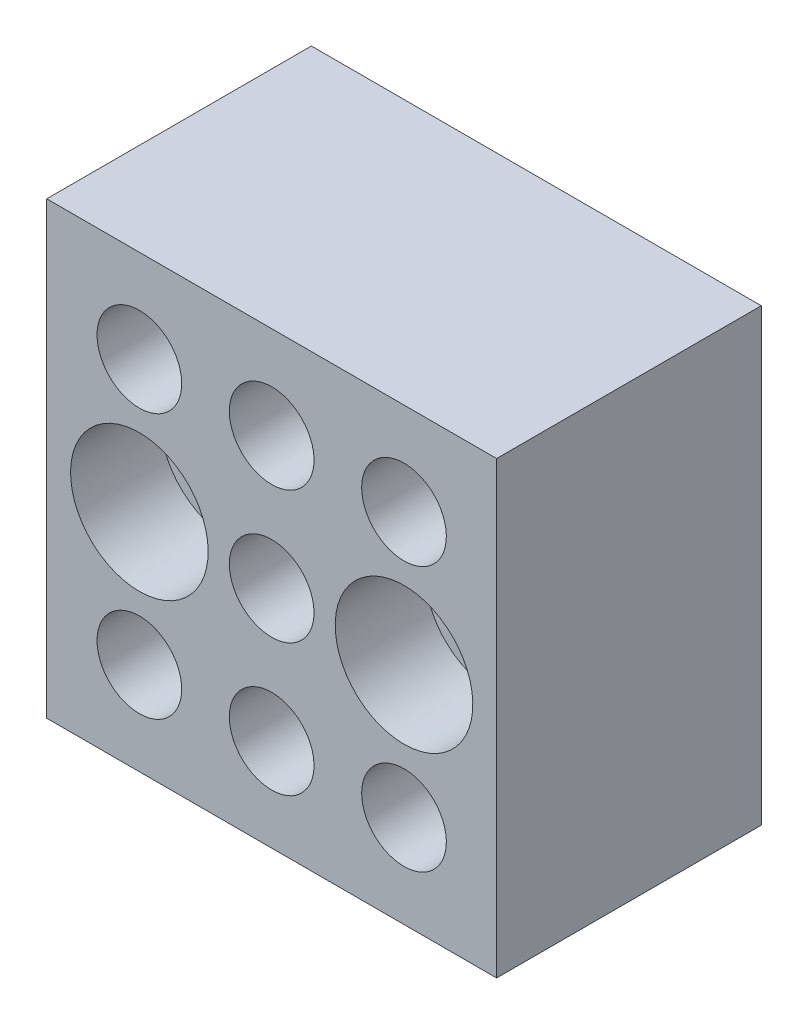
ISO-10303-21;
HEADER;
FILE_DESCRIPTION(('STEP AP214'),'2;1');
FILE_NAME('part.step','',(''),(''),'','','');
FILE_SCHEMA(('AUTOMOTIVE_DESIGN { 1 0 10303 214 1 1 1 1 }'));
ENDSEC;
DATA;
#1=APPLICATION_CONTEXT('core data for automotive mechanical design processes');
#2=APPLICATION_PROTOCOL_DEFINITION('international standard','automotive_design',2000,#1);
#3=PRODUCT_CONTEXT('',#1,'mechanical');
#4=PRODUCT('Part','Part','',(#3));
#5=PRODUCT_RELATED_PRODUCT_CATEGORY('part','',(#4));
#6=PRODUCT_DEFINITION_FORMATION('','',#4);
#7=PRODUCT_DEFINITION_CONTEXT('part definition',#1,'design');
#8=PRODUCT_DEFINITION('design','',#6,#7);
#9=PRODUCT_DEFINITION_SHAPE('','',#8);
#10=(LENGTH_UNIT() NAMED_UNIT(*) SI_UNIT(.MILLI.,.METRE.));
#11=(NAMED_UNIT(*) PLANE_ANGLE_UNIT() SI_UNIT($,.RADIAN.));
#12=(NAMED_UNIT(*) SI_UNIT($,.STERADIAN.) SOLID_ANGLE_UNIT());
#13=UNCERTAINTY_MEASURE_WITH_UNIT(LENGTH_MEASURE(1.E-05),#10,'distance_accuracy_value','');
#14=(GEOMETRIC_REPRESENTATION_CONTEXT(3) GLOBAL_UNCERTAINTY_ASSIGNED_CONTEXT((#13)) GLOBAL_UNIT_ASSIGNED_CONTEXT((#10,
#11,#12)) REPRESENTATION_CONTEXT('',''));
#15=CARTESIAN_POINT('',(0.,0.,0.));
#16=DIRECTION('',(0.,0.,1.));
#17=DIRECTION('',(1.,0.,0.));
#18=AXIS2_PLACEMENT_3D('',#15,#16,#17);
#19=CARTESIAN_POINT('',(50.,25.,50.));
#20=DIRECTION('',(0.,0.,-1.));
#21=DIRECTION('',(0.,1.,0.));
#22=AXIS2_PLACEMENT_3D('',#19,#20,#21);
#23=CYLINDRICAL_SURFACE('',#22,8.);
#24=CARTESIAN_POINT('',(50.,25.,50.));
#25=DIRECTION('',(0.,0.,1.));
#26=DIRECTION('',(0.,-1.,0.));
#27=AXIS2_PLACEMENT_3D('',#24,#25,#26);
#28=CIRCLE('',#27,8.);
#29=CARTESIAN_POINT('',(50.,17.,50.));
#30=VERTEX_POINT('',#29);
#31=EDGE_CURVE('E105',#30,#30,#28,.T.);
#32=ORIENTED_EDGE('',*,*,#31,.T.);
#33=EDGE_LOOP('',(#32));
#34=FACE_BOUND('',#33,.T.);
#35=CARTESIAN_POINT('',(50.,25.,15.));
#36=DIRECTION('',(0.,0.,-1.));
#37=DIRECTION('',(-1.,0.,0.));
#38=AXIS2_PLACEMENT_3D('',#35,#36,#37);
#39=CIRCLE('',#38,8.);
#40=CARTESIAN_POINT('',(42.,25.,15.));
#41=VERTEX_POINT('',#40);
#42=EDGE_CURVE('E187',#41,#41,#39,.T.);
#43=ORIENTED_EDGE('',*,*,#42,.T.);
#44=EDGE_LOOP('',(#43));
#45=FACE_BOUND('',#44,.T.);
#46=ADVANCED_FACE('F14',(#34,#45),#23,.F.);
#47=CARTESIAN_POINT('',(25.,25.,50.));
#48=DIRECTION('',(0.,0.,-1.));
#49=DIRECTION('',(0.,1.,0.));
#50=AXIS2_PLACEMENT_3D('',#47,#48,#49);
#51=CYLINDRICAL_SURFACE('',#50,8.);
#52=CARTESIAN_POINT('',(25.,25.,50.));
#53=DIRECTION('',(0.,0.,1.));
#54=DIRECTION('',(0.,-1.,0.));
#55=AXIS2_PLACEMENT_3D('',#52,#53,#54);
#56=CIRCLE('',#55,8.);
#57=CARTESIAN_POINT('',(25.,17.,50.));
#58=VERTEX_POINT('',#57);
#59=EDGE_CURVE('E99',#58,#58,#56,.T.);
#60=ORIENTED_EDGE('',*,*,#59,.T.);
#61=EDGE_LOOP('',(#60));
#62=FACE_BOUND('',#61,.T.);
#63=CARTESIAN_POINT('',(25.,25.,15.));
#64=DIRECTION('',(0.,0.,-1.));
#65=DIRECTION('',(-1.,0.,0.));
#66=AXIS2_PLACEMENT_3D('',#63,#64,#65);
#67=CIRCLE('',#66,8.);
#68=CARTESIAN_POINT('',(17.,25.,15.));
#69=VERTEX_POINT('',#68);
#70=EDGE_CURVE('E178',#69,#69,#67,.T.);
#71=ORIENTED_EDGE('',*,*,#70,.T.);
#72=EDGE_LOOP('',(#71));
#73=FACE_BOUND('',#72,.T.);
#74=ADVANCED_FACE('F223',(#62,#73),#51,.F.);
#75=CARTESIAN_POINT('',(0.,25.,50.));
#76=DIRECTION('',(0.,0.,-1.));
#77=DIRECTION('',(0.,1.,0.));
#78=AXIS2_PLACEMENT_3D('',#75,#76,#77);
#79=CYLINDRICAL_SURFACE('',#78,8.);
#80=CARTESIAN_POINT('',(0.,25.,50.));
#81=DIRECTION('',(0.,0.,1.));
#82=DIRECTION('',(0.,-1.,0.));
#83=AXIS2_PLACEMENT_3D('',#80,#81,#82);
#84=CIRCLE('',#83,8.);
#85=CARTESIAN_POINT('',(0.,17.,50.));
#86=VERTEX_POINT('',#85);
#87=EDGE_CURVE('E96',#86,#86,#84,.T.);
#88=ORIENTED_EDGE('',*,*,#87,.T.);
#89=EDGE_LOOP('',(#88));
#90=FACE_BOUND('',#89,.T.);
#91=CARTESIAN_POINT('',(0.,25.,15.));
#92=DIRECTION('',(0.,0.,-1.));
#93=DIRECTION('',(-1.,0.,0.));
#94=AXIS2_PLACEMENT_3D('',#91,#92,#93);
#95=CIRCLE('',#94,8.);
#96=CARTESIAN_POINT('',(-8.,25.,15.));
#97=VERTEX_POINT('',#96);
#98=EDGE_CURVE('E169',#97,#97,#95,.T.);
#99=ORIENTED_EDGE('',*,*,#98,.T.);
#100=EDGE_LOOP('',(#99));
#101=FACE_BOUND('',#100,.T.);
#102=ADVANCED_FACE('F229',(#90,#101),#79,.F.);
#103=CARTESIAN_POINT('',(25.,0.,50.));
#104=DIRECTION('',(0.,0.,-1.));
#105=DIRECTION('',(0.,1.,0.));
#106=AXIS2_PLACEMENT_3D('',#103,#104,#105);
#107=CYLINDRICAL_SURFACE('',#106,8.);
#108=CARTESIAN_POINT('',(25.,0.,50.));
#109=DIRECTION('',(0.,0.,1.));
#110=DIRECTION('',(0.,-1.,0.));
#111=AXIS2_PLACEMENT_3D('',#108,#109,#110);
#112=CIRCLE('',#111,8.);
#113=CARTESIAN_POINT('',(25.,-8.,50.));
#114=VERTEX_POINT('',#113);
#115=EDGE_CURVE('E102',#114,#114,#112,.T.);
#116=ORIENTED_EDGE('',*,*,#115,.T.);
#117=EDGE_LOOP('',(#116));
#118=FACE_BOUND('',#117,.T.);
#119=CARTESIAN_POINT('',(25.,0.,15.));
#120=DIRECTION('',(0.,0.,-1.));
#121=DIRECTION('',(-1.,0.,0.));
#122=AXIS2_PLACEMENT_3D('',#119,#120,#121);
#123=CIRCLE('',#122,8.);
#124=CARTESIAN_POINT('',(17.,0.,15.));
#125=VERTEX_POINT('',#124);
#126=EDGE_CURVE('E160',#125,#125,#123,.T.);
#127=ORIENTED_EDGE('',*,*,#126,.T.);
#128=EDGE_LOOP('',(#127));
#129=FACE_BOUND('',#128,.T.);
#130=ADVANCED_FACE('F236',(#118,#129),#107,.F.);
#131=CARTESIAN_POINT('',(0.,-25.,50.));
#132=DIRECTION('',(0.,0.,-1.));
#133=DIRECTION('',(0.,1.,0.));
#134=AXIS2_PLACEMENT_3D('',#131,#132,#133);
#135=CYLINDRICAL_SURFACE('',#134,8.);
#136=CARTESIAN_POINT('',(0.,-25.,50.));
#137=DIRECTION('',(0.,0.,1.));
#138=DIRECTION('',(0.,-1.,0.));
#139=AXIS2_PLACEMENT_3D('',#136,#137,#138);
#140=CIRCLE('',#139,8.);
#141=CARTESIAN_POINT('',(0.,-33.,50.));
#142=VERTEX_POINT('',#141);
#143=EDGE_CURVE('E93',#142,#142,#140,.T.);
#144=ORIENTED_EDGE('',*,*,#143,.T.);
#145=EDGE_LOOP('',(#144));
#146=FACE_BOUND('',#145,.T.);
#147=CARTESIAN_POINT('',(0.,-25.,15.));
#148=DIRECTION('',(0.,0.,-1.));
#149=DIRECTION('',(-1.,0.,0.));
#150=AXIS2_PLACEMENT_3D('',#147,#148,#149);
#151=CIRCLE('',#150,8.);
#152=CARTESIAN_POINT('',(-8.,-25.,15.));
#153=VERTEX_POINT('',#152);
#154=EDGE_CURVE('E151',#153,#153,#151,.T.);
#155=ORIENTED_EDGE('',*,*,#154,.T.);
#156=EDGE_LOOP('',(#155));
#157=FACE_BOUND('',#156,.T.);
#158=ADVANCED_FACE('F238',(#146,#157),#135,.F.);
#159=CARTESIAN_POINT('',(25.,-25.,50.));
#160=DIRECTION('',(0.,0.,-1.));
#161=DIRECTION('',(0.,1.,0.));
#162=AXIS2_PLACEMENT_3D('',#159,#160,#161);
#163=CYLINDRICAL_SURFACE('',#162,8.);
#164=CARTESIAN_POINT('',(25.,-25.,50.));
#165=DIRECTION('',(0.,0.,1.));
#166=DIRECTION('',(0.,-1.,0.));
#167=AXIS2_PLACEMENT_3D('',#164,#165,#166);
#168=CIRCLE('',#167,8.);
#169=CARTESIAN_POINT('',(25.,-33.,50.));
#170=VERTEX_POINT('',#169);
#171=EDGE_CURVE('E72',#170,#170,#168,.T.);
#172=ORIENTED_EDGE('',*,*,#171,.T.);
#173=EDGE_LOOP('',(#172));
#174=FACE_BOUND('',#173,.T.);
#175=CARTESIAN_POINT('',(25.,-25.,15.));
#176=DIRECTION('',(0.,0.,-1.));
#177=DIRECTION('',(-1.,0.,0.));
#178=AXIS2_PLACEMENT_3D('',#175,#176,#177);
#179=CIRCLE('',#178,8.);
#180=CARTESIAN_POINT('',(17.,-25.,15.));
#181=VERTEX_POINT('',#180);
#182=EDGE_CURVE('E142',#181,#181,#179,.T.);
#183=ORIENTED_EDGE('',*,*,#182,.T.);
#184=EDGE_LOOP('',(#183));
#185=FACE_BOUND('',#184,.T.);
#186=ADVANCED_FACE('F245',(#174,#185),#163,.F.);
#187=CARTESIAN_POINT('',(50.,-25.,50.));
#188=DIRECTION('',(0.,0.,-1.));
#189=DIRECTION('',(0.,1.,0.));
#190=AXIS2_PLACEMENT_3D('',#187,#188,#189);
#191=CYLINDRICAL_SURFACE('',#190,8.);
#192=CARTESIAN_POINT('',(50.,-25.,50.));
#193=DIRECTION('',(0.,0.,1.));
#194=DIRECTION('',(0.,-1.,0.));
#195=AXIS2_PLACEMENT_3D('',#192,#193,#194);
#196=CIRCLE('',#195,8.);
#197=CARTESIAN_POINT('',(50.,-33.,50.));
#198=VERTEX_POINT('',#197);
#199=EDGE_CURVE('E108',#198,#198,#196,.T.);
#200=ORIENTED_EDGE('',*,*,#199,.T.);
#201=EDGE_LOOP('',(#200));
#202=FACE_BOUND('',#201,.T.);
#203=CARTESIAN_POINT('',(50.,-25.,15.));
#204=DIRECTION('',(0.,0.,-1.));
#205=DIRECTION('',(-1.,0.,0.));
#206=AXIS2_PLACEMENT_3D('',#203,#204,#205);
#207=CIRCLE('',#206,8.);
#208=CARTESIAN_POINT('',(42.,-25.,15.));
#209=VERTEX_POINT('',#208);
#210=EDGE_CURVE('E135',#209,#209,#207,.T.);
#211=ORIENTED_EDGE('',*,*,#210,.T.);
#212=EDGE_LOOP('',(#211));
#213=FACE_BOUND('',#212,.T.);
#214=ADVANCED_FACE('F218',(#202,#213),#191,.F.);
#215=CARTESIAN_POINT('',(-17.5,-42.5,50.));
#216=DIRECTION('',(0.,0.,-1.));
#217=DIRECTION('',(0.,1.,0.));
#218=AXIS2_PLACEMENT_3D('',#215,#216,#217);
#219=PLANE('',#218);
#220=CARTESIAN_POINT('',(50.,0.,50.));
#221=DIRECTION('',(0.,0.,1.));
#222=DIRECTION('',(0.,-1.,0.));
#223=AXIS2_PLACEMENT_3D('',#220,#221,#222);
#224=CIRCLE('',#223,13.);
#225=CARTESIAN_POINT('',(50.,-13.,50.));
#226=VERTEX_POINT('',#225);
#227=EDGE_CURVE('E111',#226,#226,#224,.T.);
#228=ORIENTED_EDGE('',*,*,#227,.F.);
#229=EDGE_LOOP('',(#228));
#230=FACE_BOUND('',#229,.T.);
#231=ORIENTED_EDGE('',*,*,#31,.F.);
#232=EDGE_LOOP('',(#231));
#233=FACE_BOUND('',#232,.T.);
#234=ORIENTED_EDGE('',*,*,#59,.F.);
#235=EDGE_LOOP('',(#234));
#236=FACE_BOUND('',#235,.T.);
#237=ORIENTED_EDGE('',*,*,#143,.F.);
#238=EDGE_LOOP('',(#237));
#239=FACE_BOUND('',#238,.T.);
#240=DIRECTION('',(-1.,0.,0.));
#241=VECTOR('',#240,1.);
#242=CARTESIAN_POINT('',(67.5,-42.5,50.));
#243=LINE('',#242,#241);
#244=CARTESIAN_POINT('',(67.5,-42.5,50.));
#245=VERTEX_POINT('',#244);
#246=CARTESIAN_POINT('',(-17.5,-42.5,50.));
#247=VERTEX_POINT('',#246);
#248=EDGE_CURVE('E56',#245,#247,#243,.T.);
#249=ORIENTED_EDGE('',*,*,#248,.F.);
#250=DIRECTION('',(0.,-1.,0.));
#251=VECTOR('',#250,1.);
#252=CARTESIAN_POINT('',(67.5,42.5,50.));
#253=LINE('',#252,#251);
#254=CARTESIAN_POINT('',(67.5,42.5,50.));
#255=VERTEX_POINT('',#254);
#256=EDGE_CURVE('E62',#255,#245,#253,.T.);
#257=ORIENTED_EDGE('',*,*,#256,.F.);
#258=DIRECTION('',(1.,0.,0.));
#259=VECTOR('',#258,1.);
#260=CARTESIAN_POINT('',(-17.5,42.5,50.));
#261=LINE('',#260,#259);
#262=CARTESIAN_POINT('',(-17.5,42.5,50.));
#263=VERTEX_POINT('',#262);
#264=EDGE_CURVE('E81',#263,#255,#261,.T.);
#265=ORIENTED_EDGE('',*,*,#264,.F.);
#266=DIRECTION('',(0.,1.,0.));
#267=VECTOR('',#266,1.);
#268=CARTESIAN_POINT('',(-17.5,-42.5,50.));
#269=LINE('',#268,#267);
#270=EDGE_CURVE('E83',#247,#263,#269,.T.);
#271=ORIENTED_EDGE('',*,*,#270,.F.);
#272=EDGE_LOOP('',(#249,#257,#265,#271));
#273=FACE_BOUND('',#272,.T.);
#274=ORIENTED_EDGE('',*,*,#171,.F.);
#275=EDGE_LOOP('',(#274));
#276=FACE_BOUND('',#275,.T.);
#277=ORIENTED_EDGE('',*,*,#87,.F.);
#278=EDGE_LOOP('',(#277));
#279=FACE_BOUND('',#278,.T.);
#280=ORIENTED_EDGE('',*,*,#115,.F.);
#281=EDGE_LOOP('',(#280));
#282=FACE_BOUND('',#281,.T.);
#283=ORIENTED_EDGE('',*,*,#199,.F.);
#284=EDGE_LOOP('',(#283));
#285=FACE_BOUND('',#284,.T.);
#286=CARTESIAN_POINT('',(0.,0.,50.));
#287=DIRECTION('',(0.,0.,1.));
#288=DIRECTION('',(0.,-1.,0.));
#289=AXIS2_PLACEMENT_3D('',#286,#287,#288);
#290=CIRCLE('',#289,13.);
#291=CARTESIAN_POINT('',(0.,-13.,50.));
#292=VERTEX_POINT('',#291);
#293=EDGE_CURVE('E123',#292,#292,#290,.T.);
#294=ORIENTED_EDGE('',*,*,#293,.F.);
#295=EDGE_LOOP('',(#294));
#296=FACE_BOUND('',#295,.T.);
#297=ADVANCED_FACE('F209',(#230,#233,#236,#239,#273,#276,#279,#282,#285,#296),#219,.F.);
#298=CARTESIAN_POINT('',(-17.5,-42.5,0.));
#299=DIRECTION('',(0.,0.,-1.));
#300=DIRECTION('',(0.,1.,0.));
#301=AXIS2_PLACEMENT_3D('',#298,#299,#300);
#302=PLANE('',#301);
#303=CARTESIAN_POINT('',(50.,0.,0.));
#304=DIRECTION('',(0.,0.,1.));
#305=DIRECTION('',(0.,-1.,0.));
#306=AXIS2_PLACEMENT_3D('',#303,#304,#305);
#307=CIRCLE('',#306,9.);
#308=CARTESIAN_POINT('',(50.,-9.,0.));
#309=VERTEX_POINT('',#308);
#310=EDGE_CURVE('E120',#309,#309,#307,.T.);
#311=ORIENTED_EDGE('',*,*,#310,.T.);
#312=EDGE_LOOP('',(#311));
#313=FACE_BOUND('',#312,.T.);
#314=DIRECTION('',(-1.,0.,0.));
#315=VECTOR('',#314,1.);
#316=CARTESIAN_POINT('',(67.5,-42.5,0.));
#317=LINE('',#316,#315);
#318=CARTESIAN_POINT('',(67.5,-42.5,0.));
#319=VERTEX_POINT('',#318);
#320=CARTESIAN_POINT('',(-17.5,-42.5,0.));
#321=VERTEX_POINT('',#320);
#322=EDGE_CURVE('E54',#319,#321,#317,.T.);
#323=ORIENTED_EDGE('',*,*,#322,.T.);
#324=DIRECTION('',(0.,1.,0.));
#325=VECTOR('',#324,1.);
#326=CARTESIAN_POINT('',(-17.5,-42.5,0.));
#327=LINE('',#326,#325);
#328=CARTESIAN_POINT('',(-17.5,42.5,0.));
#329=VERTEX_POINT('',#328);
#330=EDGE_CURVE('E69',#321,#329,#327,.T.);
#331=ORIENTED_EDGE('',*,*,#330,.T.);
#332=DIRECTION('',(1.,0.,0.));
#333=VECTOR('',#332,1.);
#334=CARTESIAN_POINT('',(-17.5,42.5,0.));
#335=LINE('',#334,#333);
#336=CARTESIAN_POINT('',(67.5,42.5,0.));
#337=VERTEX_POINT('',#336);
#338=EDGE_CURVE('E75',#329,#337,#335,.T.);
#339=ORIENTED_EDGE('',*,*,#338,.T.);
#340=DIRECTION('',(0.,-1.,0.));
#341=VECTOR('',#340,1.);
#342=CARTESIAN_POINT('',(67.5,42.5,0.));
#343=LINE('',#342,#341);
#344=EDGE_CURVE('E71',#337,#319,#343,.T.);
#345=ORIENTED_EDGE('',*,*,#344,.T.);
#346=EDGE_LOOP('',(#323,#331,#339,#345));
#347=FACE_BOUND('',#346,.T.);
#348=CARTESIAN_POINT('',(0.,0.,0.));
#349=DIRECTION('',(0.,0.,1.));
#350=DIRECTION('',(0.,-1.,0.));
#351=AXIS2_PLACEMENT_3D('',#348,#349,#350);
#352=CIRCLE('',#351,9.);
#353=CARTESIAN_POINT('',(0.,-9.,0.));
#354=VERTEX_POINT('',#353);
#355=EDGE_CURVE('E132',#354,#354,#352,.T.);
#356=ORIENTED_EDGE('',*,*,#355,.T.);
#357=EDGE_LOOP('',(#356));
#358=FACE_BOUND('',#357,.T.);
#359=CARTESIAN_POINT('',(50.,-25.,0.));
#360=DIRECTION('',(0.,0.,-1.));
#361=DIRECTION('',(-1.,0.,0.));
#362=AXIS2_PLACEMENT_3D('',#359,#360,#361);
#363=CIRCLE('',#362,6.9);
#364=CARTESIAN_POINT('',(43.1,-25.,0.));
#365=VERTEX_POINT('',#364);
#366=EDGE_CURVE('E139',#365,#365,#363,.T.);
#367=ORIENTED_EDGE('',*,*,#366,.F.);
#368=EDGE_LOOP('',(#367));
#369=FACE_BOUND('',#368,.T.);
#370=CARTESIAN_POINT('',(25.,-25.,0.));
#371=DIRECTION('',(0.,0.,-1.));
#372=DIRECTION('',(-1.,0.,0.));
#373=AXIS2_PLACEMENT_3D('',#370,#371,#372);
#374=CIRCLE('',#373,6.9);
#375=CARTESIAN_POINT('',(18.1,-25.,0.));
#376=VERTEX_POINT('',#375);
#377=EDGE_CURVE('E148',#376,#376,#374,.T.);
#378=ORIENTED_EDGE('',*,*,#377,.F.);
#379=EDGE_LOOP('',(#378));
#380=FACE_BOUND('',#379,.T.);
#381=CARTESIAN_POINT('',(0.,-25.,0.));
#382=DIRECTION('',(0.,0.,-1.));
#383=DIRECTION('',(-1.,0.,0.));
#384=AXIS2_PLACEMENT_3D('',#381,#382,#383);
#385=CIRCLE('',#384,6.9);
#386=CARTESIAN_POINT('',(-6.9,-25.,0.));
#387=VERTEX_POINT('',#386);
#388=EDGE_CURVE('E157',#387,#387,#385,.T.);
#389=ORIENTED_EDGE('',*,*,#388,.F.);
#390=EDGE_LOOP('',(#389));
#391=FACE_BOUND('',#390,.T.);
#392=CARTESIAN_POINT('',(25.,0.,0.));
#393=DIRECTION('',(0.,0.,-1.));
#394=DIRECTION('',(-1.,0.,0.));
#395=AXIS2_PLACEMENT_3D('',#392,#393,#394);
#396=CIRCLE('',#395,6.9);
#397=CARTESIAN_POINT('',(18.1,0.,0.));
#398=VERTEX_POINT('',#397);
#399=EDGE_CURVE('E166',#398,#398,#396,.T.);
#400=ORIENTED_EDGE('',*,*,#399,.F.);
#401=EDGE_LOOP('',(#400));
#402=FACE_BOUND('',#401,.T.);
#403=CARTESIAN_POINT('',(0.,25.,0.));
#404=DIRECTION('',(0.,0.,-1.));
#405=DIRECTION('',(-1.,0.,0.));
#406=AXIS2_PLACEMENT_3D('',#403,#404,#405);
#407=CIRCLE('',#406,6.9);
#408=CARTESIAN_POINT('',(-6.9,25.,0.));
#409=VERTEX_POINT('',#408);
#410=EDGE_CURVE('E175',#409,#409,#407,.T.);
#411=ORIENTED_EDGE('',*,*,#410,.F.);
#412=EDGE_LOOP('',(#411));
#413=FACE_BOUND('',#412,.T.);
#414=CARTESIAN_POINT('',(25.,25.,0.));
#415=DIRECTION('',(0.,0.,-1.));
#416=DIRECTION('',(-1.,0.,0.));
#417=AXIS2_PLACEMENT_3D('',#414,#415,#416);
#418=CIRCLE('',#417,6.9);
#419=CARTESIAN_POINT('',(18.1,25.,0.));
#420=VERTEX_POINT('',#419);
#421=EDGE_CURVE('E184',#420,#420,#418,.T.);
#422=ORIENTED_EDGE('',*,*,#421,.F.);
#423=EDGE_LOOP('',(#422));
#424=FACE_BOUND('',#423,.T.);
#425=CARTESIAN_POINT('',(50.,25.,0.));
#426=DIRECTION('',(0.,0.,-1.));
#427=DIRECTION('',(-1.,0.,0.));
#428=AXIS2_PLACEMENT_3D('',#425,#426,#427);
#429=CIRCLE('',#428,6.9);
#430=CARTESIAN_POINT('',(43.1,25.,0.));
#431=VERTEX_POINT('',#430);
#432=EDGE_CURVE('E193',#431,#431,#429,.T.);
#433=ORIENTED_EDGE('',*,*,#432,.F.);
#434=EDGE_LOOP('',(#433));
#435=FACE_BOUND('',#434,.T.);
#436=ADVANCED_FACE('F66',(#313,#347,#358,#369,#380,#391,#402,#413,#424,#435),#302,.T.);
#437=CARTESIAN_POINT('',(67.5,-42.5,50.));
#438=DIRECTION('',(0.,-1.,0.));
#439=DIRECTION('',(1.,0.,0.));
#440=AXIS2_PLACEMENT_3D('',#437,#438,#439);
#441=PLANE('',#440);
#442=DIRECTION('',(0.,0.,-1.));
#443=VECTOR('',#442,1.);
#444=CARTESIAN_POINT('',(67.5,-42.5,50.));
#445=LINE('',#444,#443);
#446=EDGE_CURVE('E9',#245,#319,#445,.T.);
#447=ORIENTED_EDGE('',*,*,#446,.F.);
#448=ORIENTED_EDGE('',*,*,#248,.T.);
#449=DIRECTION('',(0.,0.,-1.));
#450=VECTOR('',#449,1.);
#451=CARTESIAN_POINT('',(-17.5,-42.5,50.));
#452=LINE('',#451,#450);
#453=EDGE_CURVE('E51',#247,#321,#452,.T.);
#454=ORIENTED_EDGE('',*,*,#453,.T.);
#455=ORIENTED_EDGE('',*,*,#322,.F.);
#456=EDGE_LOOP('',(#447,#448,#454,#455));
#457=FACE_BOUND('',#456,.T.);
#458=ADVANCED_FACE('F53',(#457),#441,.T.);
#459=CARTESIAN_POINT('',(67.5,42.5,50.));
#460=DIRECTION('',(1.,0.,0.));
#461=DIRECTION('',(0.,1.,0.));
#462=AXIS2_PLACEMENT_3D('',#459,#460,#461);
#463=PLANE('',#462);
#464=DIRECTION('',(0.,0.,-1.));
#465=VECTOR('',#464,1.);
#466=CARTESIAN_POINT('',(67.5,42.5,50.));
#467=LINE('',#466,#465);
#468=EDGE_CURVE('E22',#255,#337,#467,.T.);
#469=ORIENTED_EDGE('',*,*,#468,.F.);
#470=ORIENTED_EDGE('',*,*,#256,.T.);
#471=ORIENTED_EDGE('',*,*,#446,.T.);
#472=ORIENTED_EDGE('',*,*,#344,.F.);
#473=EDGE_LOOP('',(#469,#470,#471,#472));
#474=FACE_BOUND('',#473,.T.);
#475=ADVANCED_FACE('F16',(#474),#463,.T.);
#476=CARTESIAN_POINT('',(-17.5,42.5,50.));
#477=DIRECTION('',(0.,1.,0.));
#478=DIRECTION('',(-1.,0.,0.));
#479=AXIS2_PLACEMENT_3D('',#476,#477,#478);
#480=PLANE('',#479);
#481=DIRECTION('',(0.,0.,-1.));
#482=VECTOR('',#481,1.);
#483=CARTESIAN_POINT('',(-17.5,42.5,50.));
#484=LINE('',#483,#482);
#485=EDGE_CURVE('E61',#263,#329,#484,.T.);
#486=ORIENTED_EDGE('',*,*,#485,.F.);
#487=ORIENTED_EDGE('',*,*,#264,.T.);
#488=ORIENTED_EDGE('',*,*,#468,.T.);
#489=ORIENTED_EDGE('',*,*,#338,.F.);
#490=EDGE_LOOP('',(#486,#487,#488,#489));
#491=FACE_BOUND('',#490,.T.);
#492=ADVANCED_FACE('F87',(#491),#480,.T.);
#493=CARTESIAN_POINT('',(-17.5,-42.5,50.));
#494=DIRECTION('',(-1.,0.,0.));
#495=DIRECTION('',(0.,-1.,0.));
#496=AXIS2_PLACEMENT_3D('',#493,#494,#495);
#497=PLANE('',#496);
#498=ORIENTED_EDGE('',*,*,#270,.T.);
#499=ORIENTED_EDGE('',*,*,#485,.T.);
#500=ORIENTED_EDGE('',*,*,#330,.F.);
#501=ORIENTED_EDGE('',*,*,#453,.F.);
#502=EDGE_LOOP('',(#498,#499,#500,#501));
#503=FACE_BOUND('',#502,.T.);
#504=ADVANCED_FACE('F74',(#503),#497,.T.);
#505=CARTESIAN_POINT('',(50.,0.,50.));
#506=DIRECTION('',(0.,0.,1.));
#507=DIRECTION('',(0.,-1.,0.));
#508=AXIS2_PLACEMENT_3D('',#505,#506,#507);
#509=CYLINDRICAL_SURFACE('',#508,13.);
#510=ORIENTED_EDGE('',*,*,#227,.T.);
#511=EDGE_LOOP('',(#510));
#512=FACE_BOUND('',#511,.T.);
#513=CARTESIAN_POINT('',(50.,0.,33.));
#514=DIRECTION('',(0.,0.,1.));
#515=DIRECTION('',(0.,-1.,0.));
#516=AXIS2_PLACEMENT_3D('',#513,#514,#515);
#517=CIRCLE('',#516,13.);
#518=CARTESIAN_POINT('',(50.,-13.,33.));
#519=VERTEX_POINT('',#518);
#520=EDGE_CURVE('E114',#519,#519,#517,.T.);
#521=ORIENTED_EDGE('',*,*,#520,.F.);
#522=EDGE_LOOP('',(#521));
#523=FACE_BOUND('',#522,.T.);
#524=ADVANCED_FACE('F296',(#512,#523),#509,.F.);
#525=CARTESIAN_POINT('',(50.,-9.,33.));
#526=DIRECTION('',(0.,0.,1.));
#527=DIRECTION('',(0.,-1.,0.));
#528=AXIS2_PLACEMENT_3D('',#525,#526,#527);
#529=PLANE('',#528);
#530=ORIENTED_EDGE('',*,*,#520,.T.);
#531=EDGE_LOOP('',(#530));
#532=FACE_BOUND('',#531,.T.);
#533=CARTESIAN_POINT('',(50.,0.,33.));
#534=DIRECTION('',(0.,0.,1.));
#535=DIRECTION('',(0.,-1.,0.));
#536=AXIS2_PLACEMENT_3D('',#533,#534,#535);
#537=CIRCLE('',#536,9.);
#538=CARTESIAN_POINT('',(50.,-9.,33.));
#539=VERTEX_POINT('',#538);
#540=EDGE_CURVE('E117',#539,#539,#537,.T.);
#541=ORIENTED_EDGE('',*,*,#540,.F.);
#542=EDGE_LOOP('',(#541));
#543=FACE_BOUND('',#542,.T.);
#544=ADVANCED_FACE('F293',(#532,#543),#529,.T.);
#545=CARTESIAN_POINT('',(50.,0.,50.));
#546=DIRECTION('',(0.,0.,1.));
#547=DIRECTION('',(0.,-1.,0.));
#548=AXIS2_PLACEMENT_3D('',#545,#546,#547);
#549=CYLINDRICAL_SURFACE('',#548,9.);
#550=ORIENTED_EDGE('',*,*,#540,.T.);
#551=EDGE_LOOP('',(#550));
#552=FACE_BOUND('',#551,.T.);
#553=ORIENTED_EDGE('',*,*,#310,.F.);
#554=EDGE_LOOP('',(#553));
#555=FACE_BOUND('',#554,.T.);
#556=ADVANCED_FACE('F289',(#552,#555),#549,.F.);
#557=CARTESIAN_POINT('',(0.,0.,50.));
#558=DIRECTION('',(0.,0.,1.));
#559=DIRECTION('',(0.,-1.,0.));
#560=AXIS2_PLACEMENT_3D('',#557,#558,#559);
#561=CYLINDRICAL_SURFACE('',#560,13.);
#562=ORIENTED_EDGE('',*,*,#293,.T.);
#563=EDGE_LOOP('',(#562));
#564=FACE_BOUND('',#563,.T.);
#565=CARTESIAN_POINT('',(0.,0.,33.));
#566=DIRECTION('',(0.,0.,1.));
#567=DIRECTION('',(0.,-1.,0.));
#568=AXIS2_PLACEMENT_3D('',#565,#566,#567);
#569=CIRCLE('',#568,13.);
#570=CARTESIAN_POINT('',(0.,-13.,33.));
#571=VERTEX_POINT('',#570);
#572=EDGE_CURVE('E126',#571,#571,#569,.T.);
#573=ORIENTED_EDGE('',*,*,#572,.F.);
#574=EDGE_LOOP('',(#573));
#575=FACE_BOUND('',#574,.T.);
#576=ADVANCED_FACE('F285',(#564,#575),#561,.F.);
#577=CARTESIAN_POINT('',(0.,-9.,33.));
#578=DIRECTION('',(0.,0.,1.));
#579=DIRECTION('',(0.,-1.,0.));
#580=AXIS2_PLACEMENT_3D('',#577,#578,#579);
#581=PLANE('',#580);
#582=ORIENTED_EDGE('',*,*,#572,.T.);
#583=EDGE_LOOP('',(#582));
#584=FACE_BOUND('',#583,.T.);
#585=CARTESIAN_POINT('',(0.,0.,33.));
#586=DIRECTION('',(0.,0.,1.));
#587=DIRECTION('',(0.,-1.,0.));
#588=AXIS2_PLACEMENT_3D('',#585,#586,#587);
#589=CIRCLE('',#588,9.);
#590=CARTESIAN_POINT('',(0.,-9.,33.));
#591=VERTEX_POINT('',#590);
#592=EDGE_CURVE('E129',#591,#591,#589,.T.);
#593=ORIENTED_EDGE('',*,*,#592,.F.);
#594=EDGE_LOOP('',(#593));
#595=FACE_BOUND('',#594,.T.);
#596=ADVANCED_FACE('F281',(#584,#595),#581,.T.);
#597=CARTESIAN_POINT('',(0.,0.,50.));
#598=DIRECTION('',(0.,0.,1.));
#599=DIRECTION('',(0.,-1.,0.));
#600=AXIS2_PLACEMENT_3D('',#597,#598,#599);
#601=CYLINDRICAL_SURFACE('',#600,9.);
#602=ORIENTED_EDGE('',*,*,#592,.T.);
#603=EDGE_LOOP('',(#602));
#604=FACE_BOUND('',#603,.T.);
#605=ORIENTED_EDGE('',*,*,#355,.F.);
#606=EDGE_LOOP('',(#605));
#607=FACE_BOUND('',#606,.T.);
#608=ADVANCED_FACE('F277',(#604,#607),#601,.F.);
#609=CARTESIAN_POINT('',(50.,-25.,15.));
#610=DIRECTION('',(0.,0.,-1.));
#611=DIRECTION('',(-1.,0.,0.));
#612=AXIS2_PLACEMENT_3D('',#609,#610,#611);
#613=PLANE('',#612);
#614=CARTESIAN_POINT('',(50.,-25.,15.));
#615=DIRECTION('',(0.,0.,-1.));
#616=DIRECTION('',(-1.,0.,0.));
#617=AXIS2_PLACEMENT_3D('',#614,#615,#616);
#618=CIRCLE('',#617,6.9);
#619=CARTESIAN_POINT('',(43.1,-25.,15.));
#620=VERTEX_POINT('',#619);
#621=EDGE_CURVE('E138',#620,#620,#618,.T.);
#622=ORIENTED_EDGE('',*,*,#621,.T.);
#623=EDGE_LOOP('',(#622));
#624=FACE_BOUND('',#623,.T.);
#625=ORIENTED_EDGE('',*,*,#210,.F.);
#626=EDGE_LOOP('',(#625));
#627=FACE_BOUND('',#626,.T.);
#628=ADVANCED_FACE('F270',(#624,#627),#613,.F.);
#629=CARTESIAN_POINT('',(50.,-25.,15.));
#630=DIRECTION('',(0.,0.,-1.));
#631=DIRECTION('',(-1.,0.,0.));
#632=AXIS2_PLACEMENT_3D('',#629,#630,#631);
#633=CYLINDRICAL_SURFACE('',#632,6.9);
#634=ORIENTED_EDGE('',*,*,#621,.F.);
#635=EDGE_LOOP('',(#634));
#636=FACE_BOUND('',#635,.T.);
#637=ORIENTED_EDGE('',*,*,#366,.T.);
#638=EDGE_LOOP('',(#637));
#639=FACE_BOUND('',#638,.T.);
#640=ADVANCED_FACE('F260',(#636,#639),#633,.F.);
#641=CARTESIAN_POINT('',(25.,-25.,15.));
#642=DIRECTION('',(0.,0.,-1.));
#643=DIRECTION('',(-1.,0.,0.));
#644=AXIS2_PLACEMENT_3D('',#641,#642,#643);
#645=PLANE('',#644);
#646=CARTESIAN_POINT('',(25.,-25.,15.));
#647=DIRECTION('',(0.,0.,-1.));
#648=DIRECTION('',(-1.,0.,0.));
#649=AXIS2_PLACEMENT_3D('',#646,#647,#648);
#650=CIRCLE('',#649,6.9);
#651=CARTESIAN_POINT('',(18.1,-25.,15.));
#652=VERTEX_POINT('',#651);
#653=EDGE_CURVE('E147',#652,#652,#650,.T.);
#654=ORIENTED_EDGE('',*,*,#653,.T.);
#655=EDGE_LOOP('',(#654));
#656=FACE_BOUND('',#655,.T.);
#657=ORIENTED_EDGE('',*,*,#182,.F.);
#658=EDGE_LOOP('',(#657));
#659=FACE_BOUND('',#658,.T.);
#660=ADVANCED_FACE('F257',(#656,#659),#645,.F.);
#661=CARTESIAN_POINT('',(25.,-25.,15.));
#662=DIRECTION('',(0.,0.,-1.));
#663=DIRECTION('',(-1.,0.,0.));
#664=AXIS2_PLACEMENT_3D('',#661,#662,#663);
#665=CYLINDRICAL_SURFACE('',#664,6.9);
#666=ORIENTED_EDGE('',*,*,#653,.F.);
#667=EDGE_LOOP('',(#666));
#668=FACE_BOUND('',#667,.T.);
#669=ORIENTED_EDGE('',*,*,#377,.T.);
#670=EDGE_LOOP('',(#669));
#671=FACE_BOUND('',#670,.T.);
#672=ADVANCED_FACE('F259',(#668,#671),#665,.F.);
#673=CARTESIAN_POINT('',(0.,-25.,15.));
#674=DIRECTION('',(0.,0.,-1.));
#675=DIRECTION('',(-1.,0.,0.));
#676=AXIS2_PLACEMENT_3D('',#673,#674,#675);
#677=PLANE('',#676);
#678=CARTESIAN_POINT('',(0.,-25.,15.));
#679=DIRECTION('',(0.,0.,-1.));
#680=DIRECTION('',(-1.,0.,0.));
#681=AXIS2_PLACEMENT_3D('',#678,#679,#680);
#682=CIRCLE('',#681,6.9);
#683=CARTESIAN_POINT('',(-6.9,-25.,15.));
#684=VERTEX_POINT('',#683);
#685=EDGE_CURVE('E156',#684,#684,#682,.T.);
#686=ORIENTED_EDGE('',*,*,#685,.T.);
#687=EDGE_LOOP('',(#686));
#688=FACE_BOUND('',#687,.T.);
#689=ORIENTED_EDGE('',*,*,#154,.F.);
#690=EDGE_LOOP('',(#689));
#691=FACE_BOUND('',#690,.T.);
#692=ADVANCED_FACE('F267',(#688,#691),#677,.F.);
#693=CARTESIAN_POINT('',(0.,-25.,15.));
#694=DIRECTION('',(0.,0.,-1.));
#695=DIRECTION('',(-1.,0.,0.));
#696=AXIS2_PLACEMENT_3D('',#693,#694,#695);
#697=CYLINDRICAL_SURFACE('',#696,6.9);
#698=ORIENTED_EDGE('',*,*,#685,.F.);
#699=EDGE_LOOP('',(#698));
#700=FACE_BOUND('',#699,.T.);
#701=ORIENTED_EDGE('',*,*,#388,.T.);
#702=EDGE_LOOP('',(#701));
#703=FACE_BOUND('',#702,.T.);
#704=ADVANCED_FACE('F375',(#700,#703),#697,.F.);
#705=CARTESIAN_POINT('',(25.,0.,15.));
#706=DIRECTION('',(0.,0.,-1.));
#707=DIRECTION('',(-1.,0.,0.));
#708=AXIS2_PLACEMENT_3D('',#705,#706,#707);
#709=PLANE('',#708);
#710=CARTESIAN_POINT('',(25.,0.,15.));
#711=DIRECTION('',(0.,0.,-1.));
#712=DIRECTION('',(-1.,0.,0.));
#713=AXIS2_PLACEMENT_3D('',#710,#711,#712);
#714=CIRCLE('',#713,6.9);
#715=CARTESIAN_POINT('',(18.1,0.,15.));
#716=VERTEX_POINT('',#715);
#717=EDGE_CURVE('E165',#716,#716,#714,.T.);
#718=ORIENTED_EDGE('',*,*,#717,.T.);
#719=EDGE_LOOP('',(#718));
#720=FACE_BOUND('',#719,.T.);
#721=ORIENTED_EDGE('',*,*,#126,.F.);
#722=EDGE_LOOP('',(#721));
#723=FACE_BOUND('',#722,.T.);
#724=ADVANCED_FACE('F371',(#720,#723),#709,.F.);
#725=CARTESIAN_POINT('',(25.,0.,15.));
#726=DIRECTION('',(0.,0.,-1.));
#727=DIRECTION('',(-1.,0.,0.));
#728=AXIS2_PLACEMENT_3D('',#725,#726,#727);
#729=CYLINDRICAL_SURFACE('',#728,6.9);
#730=ORIENTED_EDGE('',*,*,#717,.F.);
#731=EDGE_LOOP('',(#730));
#732=FACE_BOUND('',#731,.T.);
#733=ORIENTED_EDGE('',*,*,#399,.T.);
#734=EDGE_LOOP('',(#733));
#735=FACE_BOUND('',#734,.T.);
#736=ADVANCED_FACE('F367',(#732,#735),#729,.F.);
#737=CARTESIAN_POINT('',(0.,25.,15.));
#738=DIRECTION('',(0.,0.,-1.));
#739=DIRECTION('',(-1.,0.,0.));
#740=AXIS2_PLACEMENT_3D('',#737,#738,#739);
#741=PLANE('',#740);
#742=CARTESIAN_POINT('',(0.,25.,15.));
#743=DIRECTION('',(0.,0.,-1.));
#744=DIRECTION('',(-1.,0.,0.));
#745=AXIS2_PLACEMENT_3D('',#742,#743,#744);
#746=CIRCLE('',#745,6.9);
#747=CARTESIAN_POINT('',(-6.9,25.,15.));
#748=VERTEX_POINT('',#747);
#749=EDGE_CURVE('E174',#748,#748,#746,.T.);
#750=ORIENTED_EDGE('',*,*,#749,.T.);
#751=EDGE_LOOP('',(#750));
#752=FACE_BOUND('',#751,.T.);
#753=ORIENTED_EDGE('',*,*,#98,.F.);
#754=EDGE_LOOP('',(#753));
#755=FACE_BOUND('',#754,.T.);
#756=ADVANCED_FACE('F363',(#752,#755),#741,.F.);
#757=CARTESIAN_POINT('',(0.,25.,15.));
#758=DIRECTION('',(0.,0.,-1.));
#759=DIRECTION('',(-1.,0.,0.));
#760=AXIS2_PLACEMENT_3D('',#757,#758,#759);
#761=CYLINDRICAL_SURFACE('',#760,6.9);
#762=ORIENTED_EDGE('',*,*,#749,.F.);
#763=EDGE_LOOP('',(#762));
#764=FACE_BOUND('',#763,.T.);
#765=ORIENTED_EDGE('',*,*,#410,.T.);
#766=EDGE_LOOP('',(#765));
#767=FACE_BOUND('',#766,.T.);
#768=ADVANCED_FACE('F356',(#764,#767),#761,.F.);
#769=CARTESIAN_POINT('',(25.,25.,15.));
#770=DIRECTION('',(0.,0.,-1.));
#771=DIRECTION('',(-1.,0.,0.));
#772=AXIS2_PLACEMENT_3D('',#769,#770,#771);
#773=PLANE('',#772);
#774=CARTESIAN_POINT('',(25.,25.,15.));
#775=DIRECTION('',(0.,0.,-1.));
#776=DIRECTION('',(-1.,0.,0.));
#777=AXIS2_PLACEMENT_3D('',#774,#775,#776);
#778=CIRCLE('',#777,6.9);
#779=CARTESIAN_POINT('',(18.1,25.,15.));
#780=VERTEX_POINT('',#779);
#781=EDGE_CURVE('E183',#780,#780,#778,.T.);
#782=ORIENTED_EDGE('',*,*,#781,.T.);
#783=EDGE_LOOP('',(#782));
#784=FACE_BOUND('',#783,.T.);
#785=ORIENTED_EDGE('',*,*,#70,.F.);
#786=EDGE_LOOP('',(#785));
#787=FACE_BOUND('',#786,.T.);
#788=ADVANCED_FACE('F348',(#784,#787),#773,.F.);
#789=CARTESIAN_POINT('',(25.,25.,15.));
#790=DIRECTION('',(0.,0.,-1.));
#791=DIRECTION('',(-1.,0.,0.));
#792=AXIS2_PLACEMENT_3D('',#789,#790,#791);
#793=CYLINDRICAL_SURFACE('',#792,6.9);
#794=ORIENTED_EDGE('',*,*,#781,.F.);
#795=EDGE_LOOP('',(#794));
#796=FACE_BOUND('',#795,.T.);
#797=ORIENTED_EDGE('',*,*,#421,.T.);
#798=EDGE_LOOP('',(#797));
#799=FACE_BOUND('',#798,.T.);
#800=ADVANCED_FACE('F346',(#796,#799),#793,.F.);
#801=CARTESIAN_POINT('',(50.,25.,15.));
#802=DIRECTION('',(0.,0.,-1.));
#803=DIRECTION('',(-1.,0.,0.));
#804=AXIS2_PLACEMENT_3D('',#801,#802,#803);
#805=PLANE('',#804);
#806=CARTESIAN_POINT('',(50.,25.,15.));
#807=DIRECTION('',(0.,0.,-1.));
#808=DIRECTION('',(-1.,0.,0.));
#809=AXIS2_PLACEMENT_3D('',#806,#807,#808);
#810=CIRCLE('',#809,6.9);
#811=CARTESIAN_POINT('',(43.1,25.,15.));
#812=VERTEX_POINT('',#811);
#813=EDGE_CURVE('E192',#812,#812,#810,.T.);
#814=ORIENTED_EDGE('',*,*,#813,.T.);
#815=EDGE_LOOP('',(#814));
#816=FACE_BOUND('',#815,.T.);
#817=ORIENTED_EDGE('',*,*,#42,.F.);
#818=EDGE_LOOP('',(#817));
#819=FACE_BOUND('',#818,.T.);
#820=ADVANCED_FACE('F199',(#816,#819),#805,.F.);
#821=CARTESIAN_POINT('',(50.,25.,15.));
#822=DIRECTION('',(0.,0.,-1.));
#823=DIRECTION('',(-1.,0.,0.));
#824=AXIS2_PLACEMENT_3D('',#821,#822,#823);
#825=CYLINDRICAL_SURFACE('',#824,6.9);
#826=ORIENTED_EDGE('',*,*,#813,.F.);
#827=EDGE_LOOP('',(#826));
#828=FACE_BOUND('',#827,.T.);
#829=ORIENTED_EDGE('',*,*,#432,.T.);
#830=EDGE_LOOP('',(#829));
#831=FACE_BOUND('',#830,.T.);
#832=ADVANCED_FACE('F202',(#828,#831),#825,.F.);
#833=CLOSED_SHELL('',(#46,#74,#102,#130,#158,#186,#214,#297,#436,#458,#475,#492,#504,#524,#544,
#556,#576,#596,#608,#628,#640,#660,#672,#692,#704,#724,#736,#756,#768,#788,#800,#820,#832));
#834=MANIFOLD_SOLID_BREP('B1',#833);
#835=ADVANCED_BREP_SHAPE_REPRESENTATION('',(#18,#834),#14);
#836=SHAPE_DEFINITION_REPRESENTATION(#9,#835);
ENDSEC;
END-ISO-10303-21;
